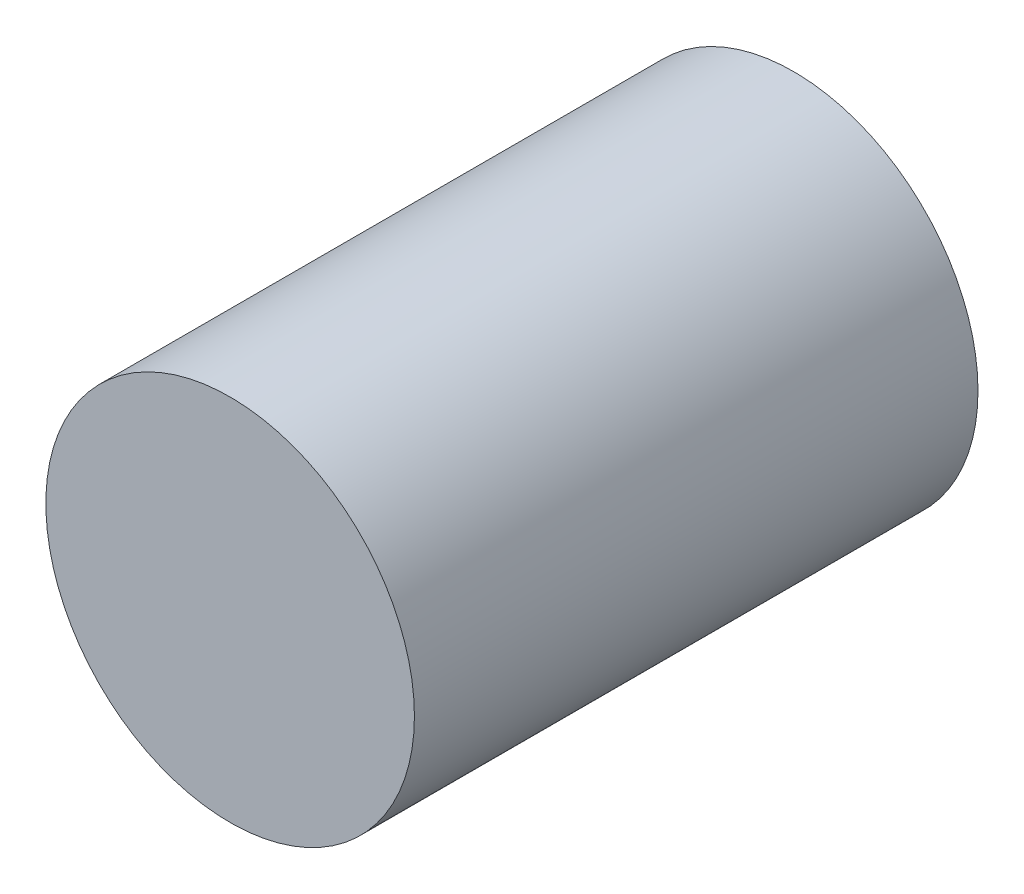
ISO-10303-21;
HEADER;
FILE_DESCRIPTION(('STEP AP214'),'2;1');
FILE_NAME('part.step','',(''),(''),'','','');
FILE_SCHEMA(('AUTOMOTIVE_DESIGN { 1 0 10303 214 1 1 1 1 }'));
ENDSEC;
DATA;
#1=APPLICATION_CONTEXT('core data for automotive mechanical design processes');
#2=APPLICATION_PROTOCOL_DEFINITION('international standard','automotive_design',2000,#1);
#3=PRODUCT_CONTEXT('',#1,'mechanical');
#4=PRODUCT('Part','Part','',(#3));
#5=PRODUCT_RELATED_PRODUCT_CATEGORY('part','',(#4));
#6=PRODUCT_DEFINITION_FORMATION('','',#4);
#7=PRODUCT_DEFINITION_CONTEXT('part definition',#1,'design');
#8=PRODUCT_DEFINITION('design','',#6,#7);
#9=PRODUCT_DEFINITION_SHAPE('','',#8);
#10=(LENGTH_UNIT() NAMED_UNIT(*) SI_UNIT(.MILLI.,.METRE.));
#11=(NAMED_UNIT(*) PLANE_ANGLE_UNIT() SI_UNIT($,.RADIAN.));
#12=(NAMED_UNIT(*) SI_UNIT($,.STERADIAN.) SOLID_ANGLE_UNIT());
#13=UNCERTAINTY_MEASURE_WITH_UNIT(LENGTH_MEASURE(1.E-05),#10,'distance_accuracy_value','');
#14=(GEOMETRIC_REPRESENTATION_CONTEXT(3) GLOBAL_UNCERTAINTY_ASSIGNED_CONTEXT((#13)) GLOBAL_UNIT_ASSIGNED_CONTEXT((#10,
#11,#12)) REPRESENTATION_CONTEXT('',''));
#15=CARTESIAN_POINT('',(0.,0.,0.));
#16=DIRECTION('',(0.,0.,1.));
#17=DIRECTION('',(1.,0.,0.));
#18=AXIS2_PLACEMENT_3D('',#15,#16,#17);
#19=CARTESIAN_POINT('',(-50.,50.,15.29));
#20=DIRECTION('',(0.,0.,-1.));
#21=DIRECTION('',(-1.,0.,0.));
#22=AXIS2_PLACEMENT_3D('',#19,#20,#21);
#23=CYLINDRICAL_SURFACE('',#22,5.00000000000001);
#24=CARTESIAN_POINT('',(-50.,50.,15.29));
#25=DIRECTION('',(0.,0.,1.));
#26=DIRECTION('',(1.,0.,0.));
#27=AXIS2_PLACEMENT_3D('',#24,#25,#26);
#28=CIRCLE('',#27,5.00000000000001);
#29=CARTESIAN_POINT('',(-45.,50.,15.29));
#30=VERTEX_POINT('',#29);
#31=EDGE_CURVE('E10',#30,#30,#28,.T.);
#32=ORIENTED_EDGE('',*,*,#31,.F.);
#33=EDGE_LOOP('',(#32));
#34=FACE_BOUND('',#33,.T.);
#35=CARTESIAN_POINT('',(-50.,50.,0.));
#36=DIRECTION('',(0.,0.,1.));
#37=DIRECTION('',(1.,0.,0.));
#38=AXIS2_PLACEMENT_3D('',#35,#36,#37);
#39=CIRCLE('',#38,5.00000000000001);
#40=CARTESIAN_POINT('',(-45.,50.,0.));
#41=VERTEX_POINT('',#40);
#42=EDGE_CURVE('E32',#41,#41,#39,.T.);
#43=ORIENTED_EDGE('',*,*,#42,.T.);
#44=EDGE_LOOP('',(#43));
#45=FACE_BOUND('',#44,.T.);
#46=ADVANCED_FACE('F26',(#34,#45),#23,.T.);
#47=CARTESIAN_POINT('',(-50.,50.,15.29));
#48=DIRECTION('',(0.,0.,1.));
#49=DIRECTION('',(1.,0.,0.));
#50=AXIS2_PLACEMENT_3D('',#47,#48,#49);
#51=PLANE('',#50);
#52=ORIENTED_EDGE('',*,*,#31,.T.);
#53=EDGE_LOOP('',(#52));
#54=FACE_BOUND('',#53,.T.);
#55=ADVANCED_FACE('F41',(#54),#51,.T.);
#56=CARTESIAN_POINT('',(-50.,50.,0.));
#57=DIRECTION('',(0.,0.,1.));
#58=DIRECTION('',(1.,0.,0.));
#59=AXIS2_PLACEMENT_3D('',#56,#57,#58);
#60=PLANE('',#59);
#61=ORIENTED_EDGE('',*,*,#42,.F.);
#62=EDGE_LOOP('',(#61));
#63=FACE_BOUND('',#62,.T.);
#64=ADVANCED_FACE('F39',(#63),#60,.F.);
#65=CLOSED_SHELL('',(#46,#55,#64));
#66=MANIFOLD_SOLID_BREP('B2',#65);
#67=ADVANCED_BREP_SHAPE_REPRESENTATION('',(#18,#66),#14);
#68=SHAPE_DEFINITION_REPRESENTATION(#9,#67);
ENDSEC;
END-ISO-10303-21;
